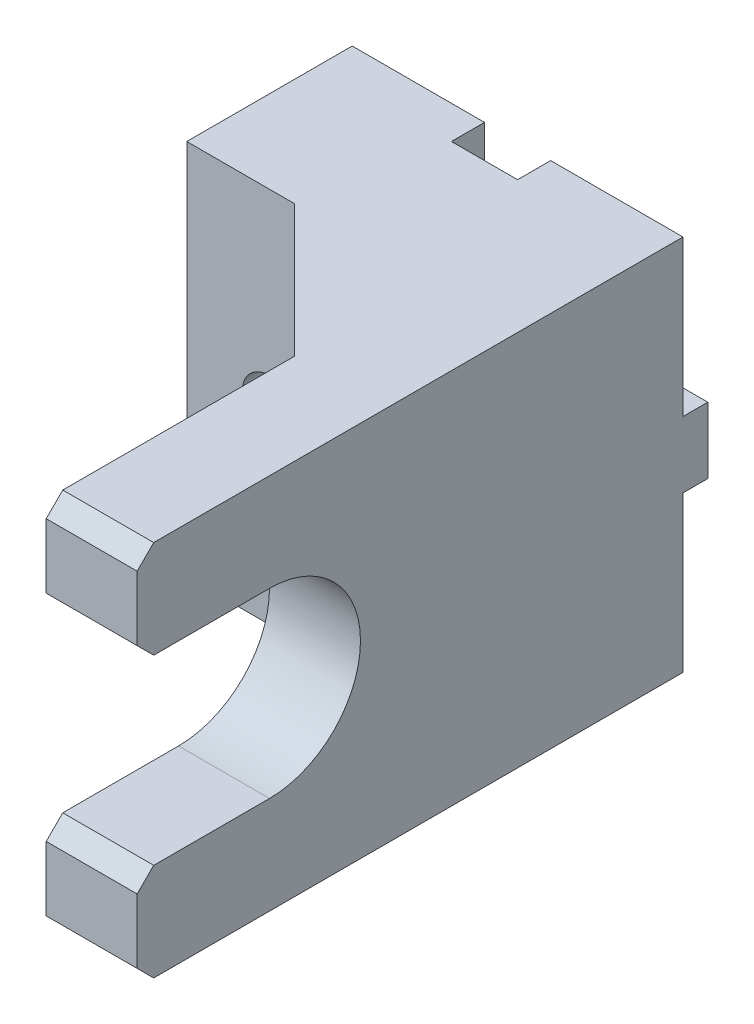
ISO-10303-21;
HEADER;
FILE_DESCRIPTION(('STEP AP214'),'2;1');
FILE_NAME('part.step','',(''),(''),'','','');
FILE_SCHEMA(('AUTOMOTIVE_DESIGN { 1 0 10303 214 1 1 1 1 }'));
ENDSEC;
DATA;
#1=APPLICATION_CONTEXT('core data for automotive mechanical design processes');
#2=APPLICATION_PROTOCOL_DEFINITION('international standard','automotive_design',2000,#1);
#3=PRODUCT_CONTEXT('',#1,'mechanical');
#4=PRODUCT('Part','Part','',(#3));
#5=PRODUCT_RELATED_PRODUCT_CATEGORY('part','',(#4));
#6=PRODUCT_DEFINITION_FORMATION('','',#4);
#7=PRODUCT_DEFINITION_CONTEXT('part definition',#1,'design');
#8=PRODUCT_DEFINITION('design','',#6,#7);
#9=PRODUCT_DEFINITION_SHAPE('','',#8);
#10=(LENGTH_UNIT() NAMED_UNIT(*) SI_UNIT(.MILLI.,.METRE.));
#11=(NAMED_UNIT(*) PLANE_ANGLE_UNIT() SI_UNIT($,.RADIAN.));
#12=(NAMED_UNIT(*) SI_UNIT($,.STERADIAN.) SOLID_ANGLE_UNIT());
#13=UNCERTAINTY_MEASURE_WITH_UNIT(LENGTH_MEASURE(1.E-05),#10,'distance_accuracy_value','');
#14=(GEOMETRIC_REPRESENTATION_CONTEXT(3) GLOBAL_UNCERTAINTY_ASSIGNED_CONTEXT((#13)) GLOBAL_UNIT_ASSIGNED_CONTEXT((#10,
#11,#12)) REPRESENTATION_CONTEXT('',''));
#15=CARTESIAN_POINT('',(0.,0.,0.));
#16=DIRECTION('',(0.,0.,1.));
#17=DIRECTION('',(1.,0.,0.));
#18=AXIS2_PLACEMENT_3D('',#15,#16,#17);
#19=CARTESIAN_POINT('',(324.220096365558,5.46,23.4927569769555));
#20=DIRECTION('',(-0.5,0.,0.866025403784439));
#21=DIRECTION('',(0.866025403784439,0.,0.5));
#22=AXIS2_PLACEMENT_3D('',#19,#20,#21);
#23=PLANE('',#22);
#24=CARTESIAN_POINT('',(322.720096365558,16.86,22.626731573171));
#25=DIRECTION('',(-0.5,0.,0.866025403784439));
#26=DIRECTION('',(-0.866025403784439,0.,-0.5));
#27=AXIS2_PLACEMENT_3D('',#24,#25,#26);
#28=ELLIPSE('',#27,1.90525588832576,1.65);
#29=CARTESIAN_POINT('',(323.354070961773,15.3366562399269,22.9927569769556));
#30=VERTEX_POINT('',#29);
#31=CARTESIAN_POINT('',(324.220096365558,16.1726136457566,23.4927569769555));
#32=VERTEX_POINT('',#31);
#33=EDGE_CURVE('E217',#30,#32,#28,.T.);
#34=ORIENTED_EDGE('',*,*,#33,.T.);
#35=DIRECTION('',(0.,1.,0.));
#36=VECTOR('',#35,1.);
#37=CARTESIAN_POINT('',(324.220096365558,5.46,23.4927569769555));
#38=LINE('',#37,#36);
#39=CARTESIAN_POINT('',(324.220096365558,17.5473863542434,23.4927569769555));
#40=VERTEX_POINT('',#39);
#41=EDGE_CURVE('E223',#32,#40,#38,.T.);
#42=ORIENTED_EDGE('',*,*,#41,.T.);
#43=CARTESIAN_POINT('',(322.720096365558,16.86,22.626731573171));
#44=DIRECTION('',(-0.5,0.,0.866025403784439));
#45=DIRECTION('',(-0.866025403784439,0.,-0.5));
#46=AXIS2_PLACEMENT_3D('',#43,#44,#45);
#47=ELLIPSE('',#46,1.90525588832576,1.65);
#48=CARTESIAN_POINT('',(323.354070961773,18.3833437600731,22.9927569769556));
#49=VERTEX_POINT('',#48);
#50=EDGE_CURVE('E19',#40,#49,#47,.T.);
#51=ORIENTED_EDGE('',*,*,#50,.T.);
#52=DIRECTION('',(0.,1.,0.));
#53=VECTOR('',#52,1.);
#54=CARTESIAN_POINT('',(323.354070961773,5.46,22.9927569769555));
#55=LINE('',#54,#53);
#56=EDGE_CURVE('E236',#30,#49,#55,.T.);
#57=ORIENTED_EDGE('',*,*,#56,.F.);
#58=EDGE_LOOP('',(#34,#42,#51,#57));
#59=FACE_BOUND('',#58,.T.);
#60=ADVANCED_FACE('F16',(#59),#23,.T.);
#61=CARTESIAN_POINT('',(333.720096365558,16.86,26.1927569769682));
#62=DIRECTION('',(0.,0.,-1.));
#63=DIRECTION('',(-1.,0.,0.));
#64=AXIS2_PLACEMENT_3D('',#61,#62,#63);
#65=CONICAL_SURFACE('',#64,1.65000000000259,1.02974425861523);
#66=CARTESIAN_POINT('',(333.720096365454,16.86,27.1841769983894));
#67=VERTEX_POINT('',#66);
#68=VERTEX_LOOP('',#67);
#69=FACE_BOUND('',#68,.T.);
#70=CARTESIAN_POINT('',(333.720096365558,16.86,26.1927569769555));
#71=DIRECTION('',(0.,0.,-1.));
#72=DIRECTION('',(-1.,0.,0.));
#73=AXIS2_PLACEMENT_3D('',#70,#71,#72);
#74=CIRCLE('',#73,1.65);
#75=CARTESIAN_POINT('',(332.070096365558,16.86,26.1927569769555));
#76=VERTEX_POINT('',#75);
#77=EDGE_CURVE('E242',#76,#76,#74,.T.);
#78=ORIENTED_EDGE('',*,*,#77,.T.);
#79=EDGE_LOOP('',(#78));
#80=FACE_BOUND('',#79,.T.);
#81=ADVANCED_FACE('F649',(#69,#80),#65,.F.);
#82=CARTESIAN_POINT('',(323.354070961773,5.46,22.9927569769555));
#83=DIRECTION('',(0.0783008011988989,0.,-0.996929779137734));
#84=DIRECTION('',(-0.996929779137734,0.,-0.0783008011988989));
#85=AXIS2_PLACEMENT_3D('',#82,#83,#84);
#86=PLANE('',#85);
#87=ORIENTED_EDGE('',*,*,#56,.T.);
#88=CARTESIAN_POINT('',(322.720096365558,16.86,22.9429633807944));
#89=DIRECTION('',(0.0783008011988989,0.,-0.996929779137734));
#90=DIRECTION('',(-0.996929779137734,0.,-0.0783008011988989));
#91=AXIS2_PLACEMENT_3D('',#88,#89,#90);
#92=ELLIPSE('',#91,1.65508146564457,1.65);
#93=EDGE_CURVE('E212',#49,#30,#92,.T.);
#94=ORIENTED_EDGE('',*,*,#93,.T.);
#95=EDGE_LOOP('',(#87,#94));
#96=FACE_BOUND('',#95,.T.);
#97=ADVANCED_FACE('F647',(#96),#86,.T.);
#98=CARTESIAN_POINT('',(317.720096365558,14.86,13.4927569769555));
#99=DIRECTION('',(0.,-1.,0.));
#100=DIRECTION('',(0.,0.,-1.));
#101=AXIS2_PLACEMENT_3D('',#98,#99,#100);
#102=PLANE('',#101);
#103=DIRECTION('',(-1.,0.,0.));
#104=VECTOR('',#103,1.);
#105=CARTESIAN_POINT('',(327.720096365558,14.86,11.9927569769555));
#106=LINE('',#105,#104);
#107=CARTESIAN_POINT('',(325.720096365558,14.86,11.9927569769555));
#108=VERTEX_POINT('',#107);
#109=CARTESIAN_POINT('',(317.720096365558,14.86,11.9927569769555));
#110=VERTEX_POINT('',#109);
#111=EDGE_CURVE('E265',#108,#110,#106,.T.);
#112=ORIENTED_EDGE('',*,*,#111,.F.);
#113=DIRECTION('',(0.,0.,-1.));
#114=VECTOR('',#113,1.);
#115=CARTESIAN_POINT('',(325.720096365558,14.86,13.4927569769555));
#116=LINE('',#115,#114);
#117=CARTESIAN_POINT('',(325.720096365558,14.86,13.4927569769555));
#118=VERTEX_POINT('',#117);
#119=EDGE_CURVE('E280',#108,#118,#116,.F.);
#120=ORIENTED_EDGE('',*,*,#119,.T.);
#121=DIRECTION('',(-1.,0.,0.));
#122=VECTOR('',#121,1.);
#123=CARTESIAN_POINT('',(364.220096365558,14.86,13.4927569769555));
#124=LINE('',#123,#122);
#125=CARTESIAN_POINT('',(317.720096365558,14.86,13.4927569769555));
#126=VERTEX_POINT('',#125);
#127=EDGE_CURVE('E258',#126,#118,#124,.F.);
#128=ORIENTED_EDGE('',*,*,#127,.F.);
#129=DIRECTION('',(0.,0.,-1.));
#130=VECTOR('',#129,1.);
#131=CARTESIAN_POINT('',(317.720096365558,14.86,13.4927569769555));
#132=LINE('',#131,#130);
#133=EDGE_CURVE('E238',#126,#110,#132,.T.);
#134=ORIENTED_EDGE('',*,*,#133,.T.);
#135=EDGE_LOOP('',(#112,#120,#128,#134));
#136=FACE_BOUND('',#135,.T.);
#137=ADVANCED_FACE('F285',(#136),#102,.T.);
#138=CARTESIAN_POINT('',(337.720096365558,18.86,13.4927569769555));
#139=DIRECTION('',(0.,1.,0.));
#140=DIRECTION('',(0.,0.,1.));
#141=AXIS2_PLACEMENT_3D('',#138,#139,#140);
#142=PLANE('',#141);
#143=DIRECTION('',(0.,0.,1.));
#144=VECTOR('',#143,1.);
#145=CARTESIAN_POINT('',(317.720096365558,18.86,13.4927569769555));
#146=LINE('',#145,#144);
#147=CARTESIAN_POINT('',(317.720096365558,18.86,11.9927569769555));
#148=VERTEX_POINT('',#147);
#149=CARTESIAN_POINT('',(317.720096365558,18.86,13.4927569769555));
#150=VERTEX_POINT('',#149);
#151=EDGE_CURVE('E273',#148,#150,#146,.T.);
#152=ORIENTED_EDGE('',*,*,#151,.T.);
#153=DIRECTION('',(-1.,0.,0.));
#154=VECTOR('',#153,1.);
#155=CARTESIAN_POINT('',(364.220096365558,18.86,13.4927569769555));
#156=LINE('',#155,#154);
#157=CARTESIAN_POINT('',(325.720096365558,18.86,13.4927569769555));
#158=VERTEX_POINT('',#157);
#159=EDGE_CURVE('E299',#158,#150,#156,.T.);
#160=ORIENTED_EDGE('',*,*,#159,.F.);
#161=DIRECTION('',(0.,0.,1.));
#162=VECTOR('',#161,1.);
#163=CARTESIAN_POINT('',(325.720096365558,18.86,10.9927569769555));
#164=LINE('',#163,#162);
#165=CARTESIAN_POINT('',(325.720096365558,18.86,11.9927569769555));
#166=VERTEX_POINT('',#165);
#167=EDGE_CURVE('E309',#158,#166,#164,.F.);
#168=ORIENTED_EDGE('',*,*,#167,.T.);
#169=DIRECTION('',(-1.,0.,0.));
#170=VECTOR('',#169,1.);
#171=CARTESIAN_POINT('',(327.720096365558,18.86,11.9927569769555));
#172=LINE('',#171,#170);
#173=EDGE_CURVE('E261',#148,#166,#172,.F.);
#174=ORIENTED_EDGE('',*,*,#173,.F.);
#175=EDGE_LOOP('',(#152,#160,#168,#174));
#176=FACE_BOUND('',#175,.T.);
#177=ADVANCED_FACE('F641',(#176),#142,.T.);
#178=CARTESIAN_POINT('',(327.720096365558,16.86,11.9927569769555));
#179=DIRECTION('',(0.,0.,-1.));
#180=DIRECTION('',(-1.,0.,0.));
#181=AXIS2_PLACEMENT_3D('',#178,#179,#180);
#182=PLANE('',#181);
#183=CARTESIAN_POINT('',(322.720096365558,16.86,11.9927569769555));
#184=DIRECTION('',(0.,0.,-1.));
#185=DIRECTION('',(-1.,0.,0.));
#186=AXIS2_PLACEMENT_3D('',#183,#184,#185);
#187=CIRCLE('',#186,1.65);
#188=CARTESIAN_POINT('',(321.070096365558,16.86,11.9927569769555));
#189=VERTEX_POINT('',#188);
#190=EDGE_CURVE('E259',#189,#189,#187,.F.);
#191=ORIENTED_EDGE('',*,*,#190,.T.);
#192=EDGE_LOOP('',(#191));
#193=FACE_BOUND('',#192,.T.);
#194=DIRECTION('',(0.,1.,0.));
#195=VECTOR('',#194,1.);
#196=CARTESIAN_POINT('',(317.720096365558,23.26,11.9927569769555));
#197=LINE('',#196,#195);
#198=EDGE_CURVE('E291',#148,#110,#197,.F.);
#199=ORIENTED_EDGE('',*,*,#198,.F.);
#200=ORIENTED_EDGE('',*,*,#173,.T.);
#201=DIRECTION('',(0.,1.,0.));
#202=VECTOR('',#201,1.);
#203=CARTESIAN_POINT('',(325.720096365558,30.5400024,11.9927569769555));
#204=LINE('',#203,#202);
#205=EDGE_CURVE('E292',#166,#108,#204,.F.);
#206=ORIENTED_EDGE('',*,*,#205,.T.);
#207=ORIENTED_EDGE('',*,*,#111,.T.);
#208=EDGE_LOOP('',(#199,#200,#206,#207));
#209=FACE_BOUND('',#208,.T.);
#210=ADVANCED_FACE('F290',(#193,#209),#182,.T.);
#211=CARTESIAN_POINT('',(322.720096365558,16.86,13.9927569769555));
#212=DIRECTION('',(0.,0.,-1.));
#213=DIRECTION('',(-1.,0.,0.));
#214=AXIS2_PLACEMENT_3D('',#211,#212,#213);
#215=CYLINDRICAL_SURFACE('',#214,1.65);
#216=ORIENTED_EDGE('',*,*,#190,.F.);
#217=EDGE_LOOP('',(#216));
#218=FACE_BOUND('',#217,.T.);
#219=CARTESIAN_POINT('',(322.720096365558,16.86,23.4927569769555));
#220=DIRECTION('',(0.,0.,-1.));
#221=DIRECTION('',(-1.,0.,0.));
#222=AXIS2_PLACEMENT_3D('',#219,#220,#221);
#223=CIRCLE('',#222,1.65);
#224=EDGE_CURVE('E210',#40,#32,#223,.F.);
#225=ORIENTED_EDGE('',*,*,#224,.T.);
#226=ORIENTED_EDGE('',*,*,#33,.F.);
#227=ORIENTED_EDGE('',*,*,#93,.F.);
#228=ORIENTED_EDGE('',*,*,#50,.F.);
#229=EDGE_LOOP('',(#225,#226,#227,#228));
#230=FACE_BOUND('',#229,.T.);
#231=ADVANCED_FACE('F207',(#218,#230),#215,.F.);
#232=CARTESIAN_POINT('',(364.220096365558,16.86,13.4927569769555));
#233=DIRECTION('',(0.,0.,-1.));
#234=DIRECTION('',(-1.,0.,0.));
#235=AXIS2_PLACEMENT_3D('',#232,#233,#234);
#236=PLANE('',#235);
#237=DIRECTION('',(0.,1.,0.));
#238=VECTOR('',#237,1.);
#239=CARTESIAN_POINT('',(317.720096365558,23.26,13.4927569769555));
#240=LINE('',#239,#238);
#241=CARTESIAN_POINT('',(317.720096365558,5.46,13.4927569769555));
#242=VERTEX_POINT('',#241);
#243=EDGE_CURVE('E295',#126,#242,#240,.F.);
#244=ORIENTED_EDGE('',*,*,#243,.F.);
#245=ORIENTED_EDGE('',*,*,#127,.T.);
#246=DIRECTION('',(0.,1.,0.));
#247=VECTOR('',#246,1.);
#248=CARTESIAN_POINT('',(325.720096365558,30.5400024,13.4927569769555));
#249=LINE('',#248,#247);
#250=CARTESIAN_POINT('',(325.720096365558,5.46,13.4927569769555));
#251=VERTEX_POINT('',#250);
#252=EDGE_CURVE('E313',#118,#251,#249,.F.);
#253=ORIENTED_EDGE('',*,*,#252,.T.);
#254=DIRECTION('',(1.,0.,0.));
#255=VECTOR('',#254,1.);
#256=CARTESIAN_POINT('',(334.970096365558,5.46,13.4927569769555));
#257=LINE('',#256,#255);
#258=EDGE_CURVE('E438',#242,#251,#257,.T.);
#259=ORIENTED_EDGE('',*,*,#258,.F.);
#260=EDGE_LOOP('',(#244,#245,#253,#259));
#261=FACE_BOUND('',#260,.T.);
#262=ADVANCED_FACE('F631',(#261),#236,.T.);
#263=CARTESIAN_POINT('',(317.720096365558,14.86,13.4927569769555));
#264=DIRECTION('',(0.,-1.,0.));
#265=DIRECTION('',(0.,0.,-1.));
#266=AXIS2_PLACEMENT_3D('',#263,#264,#265);
#267=PLANE('',#266);
#268=DIRECTION('',(0.,0.,-1.));
#269=VECTOR('',#268,1.);
#270=CARTESIAN_POINT('',(337.720096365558,14.86,13.4927569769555));
#271=LINE('',#270,#269);
#272=CARTESIAN_POINT('',(337.720096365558,14.86,11.9927569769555));
#273=VERTEX_POINT('',#272);
#274=CARTESIAN_POINT('',(337.720096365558,14.86,13.4927569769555));
#275=VERTEX_POINT('',#274);
#276=EDGE_CURVE('E323',#273,#275,#271,.F.);
#277=ORIENTED_EDGE('',*,*,#276,.T.);
#278=DIRECTION('',(-1.,0.,0.));
#279=VECTOR('',#278,1.);
#280=CARTESIAN_POINT('',(364.220096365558,14.86,13.4927569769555));
#281=LINE('',#280,#279);
#282=CARTESIAN_POINT('',(329.720096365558,14.86,13.4927569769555));
#283=VERTEX_POINT('',#282);
#284=EDGE_CURVE('E417',#283,#275,#281,.F.);
#285=ORIENTED_EDGE('',*,*,#284,.F.);
#286=DIRECTION('',(0.,0.,-1.));
#287=VECTOR('',#286,1.);
#288=CARTESIAN_POINT('',(329.720096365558,14.86,15.4927569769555));
#289=LINE('',#288,#287);
#290=CARTESIAN_POINT('',(329.720096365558,14.86,11.9927569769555));
#291=VERTEX_POINT('',#290);
#292=EDGE_CURVE('E319',#283,#291,#289,.T.);
#293=ORIENTED_EDGE('',*,*,#292,.T.);
#294=DIRECTION('',(-1.,0.,0.));
#295=VECTOR('',#294,1.);
#296=CARTESIAN_POINT('',(327.720096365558,14.86,11.9927569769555));
#297=LINE('',#296,#295);
#298=EDGE_CURVE('E414',#273,#291,#297,.T.);
#299=ORIENTED_EDGE('',*,*,#298,.F.);
#300=EDGE_LOOP('',(#277,#285,#293,#299));
#301=FACE_BOUND('',#300,.T.);
#302=ADVANCED_FACE('F627',(#301),#267,.T.);
#303=CARTESIAN_POINT('',(333.720096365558,16.86,11.9927569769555));
#304=DIRECTION('',(0.,0.,-1.));
#305=DIRECTION('',(-1.,0.,0.));
#306=AXIS2_PLACEMENT_3D('',#303,#304,#305);
#307=CYLINDRICAL_SURFACE('',#306,1.65);
#308=ORIENTED_EDGE('',*,*,#77,.F.);
#309=EDGE_LOOP('',(#308));
#310=FACE_BOUND('',#309,.T.);
#311=CARTESIAN_POINT('',(333.720096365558,16.86,11.9927569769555));
#312=DIRECTION('',(0.,0.,-1.));
#313=DIRECTION('',(-1.,0.,0.));
#314=AXIS2_PLACEMENT_3D('',#311,#312,#313);
#315=CIRCLE('',#314,1.65);
#316=CARTESIAN_POINT('',(332.070096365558,16.86,11.9927569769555));
#317=VERTEX_POINT('',#316);
#318=EDGE_CURVE('E252',#317,#317,#315,.F.);
#319=ORIENTED_EDGE('',*,*,#318,.F.);
#320=EDGE_LOOP('',(#319));
#321=FACE_BOUND('',#320,.T.);
#322=ADVANCED_FACE('F623',(#310,#321),#307,.F.);
#323=CARTESIAN_POINT('',(337.720096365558,18.86,13.4927569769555));
#324=DIRECTION('',(0.,1.,0.));
#325=DIRECTION('',(0.,0.,1.));
#326=AXIS2_PLACEMENT_3D('',#323,#324,#325);
#327=PLANE('',#326);
#328=DIRECTION('',(-1.,0.,0.));
#329=VECTOR('',#328,1.);
#330=CARTESIAN_POINT('',(327.720096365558,18.86,11.9927569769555));
#331=LINE('',#330,#329);
#332=CARTESIAN_POINT('',(329.720096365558,18.86,11.9927569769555));
#333=VERTEX_POINT('',#332);
#334=CARTESIAN_POINT('',(337.720096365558,18.86,11.9927569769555));
#335=VERTEX_POINT('',#334);
#336=EDGE_CURVE('E255',#333,#335,#331,.F.);
#337=ORIENTED_EDGE('',*,*,#336,.F.);
#338=DIRECTION('',(0.,0.,-1.));
#339=VECTOR('',#338,1.);
#340=CARTESIAN_POINT('',(329.720096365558,18.86,15.4927569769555));
#341=LINE('',#340,#339);
#342=CARTESIAN_POINT('',(329.720096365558,18.86,13.4927569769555));
#343=VERTEX_POINT('',#342);
#344=EDGE_CURVE('E317',#333,#343,#341,.F.);
#345=ORIENTED_EDGE('',*,*,#344,.T.);
#346=DIRECTION('',(-1.,0.,0.));
#347=VECTOR('',#346,1.);
#348=CARTESIAN_POINT('',(364.220096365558,18.86,13.4927569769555));
#349=LINE('',#348,#347);
#350=CARTESIAN_POINT('',(337.720096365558,18.86,13.4927569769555));
#351=VERTEX_POINT('',#350);
#352=EDGE_CURVE('E254',#351,#343,#349,.T.);
#353=ORIENTED_EDGE('',*,*,#352,.F.);
#354=DIRECTION('',(0.,0.,1.));
#355=VECTOR('',#354,1.);
#356=CARTESIAN_POINT('',(337.720096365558,18.86,13.4927569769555));
#357=LINE('',#356,#355);
#358=EDGE_CURVE('E321',#351,#335,#357,.F.);
#359=ORIENTED_EDGE('',*,*,#358,.T.);
#360=EDGE_LOOP('',(#337,#345,#353,#359));
#361=FACE_BOUND('',#360,.T.);
#362=ADVANCED_FACE('F619',(#361),#327,.T.);
#363=CARTESIAN_POINT('',(329.720096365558,30.5400024,15.4927569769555));
#364=DIRECTION('',(1.,0.,0.));
#365=DIRECTION('',(0.,0.,-1.));
#366=AXIS2_PLACEMENT_3D('',#363,#364,#365);
#367=PLANE('',#366);
#368=DIRECTION('',(0.,1.,0.));
#369=VECTOR('',#368,1.);
#370=CARTESIAN_POINT('',(329.720096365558,16.86,13.4927569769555));
#371=LINE('',#370,#369);
#372=CARTESIAN_POINT('',(329.720096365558,28.26,13.4927569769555));
#373=VERTEX_POINT('',#372);
#374=EDGE_CURVE('E405',#343,#373,#371,.T.);
#375=ORIENTED_EDGE('',*,*,#374,.F.);
#376=ORIENTED_EDGE('',*,*,#344,.F.);
#377=DIRECTION('',(0.,1.,0.));
#378=VECTOR('',#377,1.);
#379=CARTESIAN_POINT('',(329.720096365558,16.86,11.9927569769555));
#380=LINE('',#379,#378);
#381=EDGE_CURVE('E411',#291,#333,#380,.T.);
#382=ORIENTED_EDGE('',*,*,#381,.F.);
#383=ORIENTED_EDGE('',*,*,#292,.F.);
#384=DIRECTION('',(0.,1.,0.));
#385=VECTOR('',#384,1.);
#386=CARTESIAN_POINT('',(329.720096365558,16.86,13.4927569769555));
#387=LINE('',#386,#385);
#388=CARTESIAN_POINT('',(329.720096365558,5.46,13.4927569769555));
#389=VERTEX_POINT('',#388);
#390=EDGE_CURVE('E420',#389,#283,#387,.T.);
#391=ORIENTED_EDGE('',*,*,#390,.F.);
#392=DIRECTION('',(0.,0.,-1.));
#393=VECTOR('',#392,1.);
#394=CARTESIAN_POINT('',(329.720096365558,5.46,29.9927569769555));
#395=LINE('',#394,#393);
#396=CARTESIAN_POINT('',(329.720096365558,5.46,15.4927569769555));
#397=VERTEX_POINT('',#396);
#398=EDGE_CURVE('E430',#397,#389,#395,.T.);
#399=ORIENTED_EDGE('',*,*,#398,.F.);
#400=DIRECTION('',(0.,1.,0.));
#401=VECTOR('',#400,1.);
#402=CARTESIAN_POINT('',(329.720096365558,30.5400024,15.4927569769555));
#403=LINE('',#402,#401);
#404=CARTESIAN_POINT('',(329.720096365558,28.26,15.4927569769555));
#405=VERTEX_POINT('',#404);
#406=EDGE_CURVE('E315',#397,#405,#403,.T.);
#407=ORIENTED_EDGE('',*,*,#406,.T.);
#408=DIRECTION('',(0.,0.,1.));
#409=VECTOR('',#408,1.);
#410=CARTESIAN_POINT('',(329.720096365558,28.26,21.4927569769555));
#411=LINE('',#410,#409);
#412=EDGE_CURVE('E399',#373,#405,#411,.T.);
#413=ORIENTED_EDGE('',*,*,#412,.F.);
#414=EDGE_LOOP('',(#375,#376,#382,#383,#391,#399,#407,#413));
#415=FACE_BOUND('',#414,.T.);
#416=ADVANCED_FACE('F615',(#415),#367,.F.);
#417=CARTESIAN_POINT('',(325.720096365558,30.5400024,15.4927569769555));
#418=DIRECTION('',(0.,0.,1.));
#419=DIRECTION('',(1.,0.,0.));
#420=AXIS2_PLACEMENT_3D('',#417,#418,#419);
#421=PLANE('',#420);
#422=DIRECTION('',(0.,1.,0.));
#423=VECTOR('',#422,1.);
#424=CARTESIAN_POINT('',(325.720096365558,30.5400024,15.4927569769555));
#425=LINE('',#424,#423);
#426=CARTESIAN_POINT('',(325.720096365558,5.46,15.4927569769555));
#427=VERTEX_POINT('',#426);
#428=CARTESIAN_POINT('',(325.720096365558,28.26,15.4927569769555));
#429=VERTEX_POINT('',#428);
#430=EDGE_CURVE('E311',#427,#429,#425,.T.);
#431=ORIENTED_EDGE('',*,*,#430,.T.);
#432=DIRECTION('',(1.,0.,0.));
#433=VECTOR('',#432,1.);
#434=CARTESIAN_POINT('',(337.720096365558,28.26,15.4927569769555));
#435=LINE('',#434,#433);
#436=EDGE_CURVE('E396',#405,#429,#435,.F.);
#437=ORIENTED_EDGE('',*,*,#436,.F.);
#438=ORIENTED_EDGE('',*,*,#406,.F.);
#439=DIRECTION('',(1.,0.,0.));
#440=VECTOR('',#439,1.);
#441=CARTESIAN_POINT('',(334.970096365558,5.46,15.4927569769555));
#442=LINE('',#441,#440);
#443=EDGE_CURVE('E432',#427,#397,#442,.T.);
#444=ORIENTED_EDGE('',*,*,#443,.F.);
#445=EDGE_LOOP('',(#431,#437,#438,#444));
#446=FACE_BOUND('',#445,.T.);
#447=ADVANCED_FACE('F611',(#446),#421,.F.);
#448=CARTESIAN_POINT('',(325.720096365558,30.5400024,10.9927569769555));
#449=DIRECTION('',(-1.,0.,0.));
#450=DIRECTION('',(0.,0.,1.));
#451=AXIS2_PLACEMENT_3D('',#448,#449,#450);
#452=PLANE('',#451);
#453=ORIENTED_EDGE('',*,*,#205,.F.);
#454=ORIENTED_EDGE('',*,*,#167,.F.);
#455=DIRECTION('',(0.,1.,0.));
#456=VECTOR('',#455,1.);
#457=CARTESIAN_POINT('',(325.720096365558,16.86,13.4927569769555));
#458=LINE('',#457,#456);
#459=CARTESIAN_POINT('',(325.720096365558,28.26,13.4927569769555));
#460=VERTEX_POINT('',#459);
#461=EDGE_CURVE('E305',#460,#158,#458,.F.);
#462=ORIENTED_EDGE('',*,*,#461,.F.);
#463=DIRECTION('',(0.,0.,1.));
#464=VECTOR('',#463,1.);
#465=CARTESIAN_POINT('',(325.720096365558,28.26,21.4927569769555));
#466=LINE('',#465,#464);
#467=EDGE_CURVE('E389',#429,#460,#466,.F.);
#468=ORIENTED_EDGE('',*,*,#467,.F.);
#469=ORIENTED_EDGE('',*,*,#430,.F.);
#470=DIRECTION('',(0.,0.,-1.));
#471=VECTOR('',#470,1.);
#472=CARTESIAN_POINT('',(325.720096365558,5.46,29.9927569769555));
#473=LINE('',#472,#471);
#474=EDGE_CURVE('E435',#251,#427,#473,.F.);
#475=ORIENTED_EDGE('',*,*,#474,.F.);
#476=ORIENTED_EDGE('',*,*,#252,.F.);
#477=ORIENTED_EDGE('',*,*,#119,.F.);
#478=EDGE_LOOP('',(#453,#454,#462,#468,#469,#475,#476,#477));
#479=FACE_BOUND('',#478,.T.);
#480=ADVANCED_FACE('F607',(#479),#452,.F.);
#481=CARTESIAN_POINT('',(364.220096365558,16.86,13.4927569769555));
#482=DIRECTION('',(0.,0.,-1.));
#483=DIRECTION('',(-1.,0.,0.));
#484=AXIS2_PLACEMENT_3D('',#481,#482,#483);
#485=PLANE('',#484);
#486=DIRECTION('',(0.,1.,0.));
#487=VECTOR('',#486,1.);
#488=CARTESIAN_POINT('',(317.720096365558,23.26,13.4927569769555));
#489=LINE('',#488,#487);
#490=CARTESIAN_POINT('',(317.720096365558,28.26,13.4927569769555));
#491=VERTEX_POINT('',#490);
#492=EDGE_CURVE('E296',#491,#150,#489,.F.);
#493=ORIENTED_EDGE('',*,*,#492,.F.);
#494=DIRECTION('',(1.,0.,0.));
#495=VECTOR('',#494,1.);
#496=CARTESIAN_POINT('',(337.720096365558,28.26,13.4927569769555));
#497=LINE('',#496,#495);
#498=EDGE_CURVE('E385',#460,#491,#497,.F.);
#499=ORIENTED_EDGE('',*,*,#498,.F.);
#500=ORIENTED_EDGE('',*,*,#461,.T.);
#501=ORIENTED_EDGE('',*,*,#159,.T.);
#502=EDGE_LOOP('',(#493,#499,#500,#501));
#503=FACE_BOUND('',#502,.T.);
#504=ADVANCED_FACE('F604',(#503),#485,.T.);
#505=CARTESIAN_POINT('',(317.720096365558,23.26,21.4927569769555));
#506=DIRECTION('',(-1.,0.,0.));
#507=DIRECTION('',(0.,0.,1.));
#508=AXIS2_PLACEMENT_3D('',#505,#506,#507);
#509=PLANE('',#508);
#510=ORIENTED_EDGE('',*,*,#243,.T.);
#511=DIRECTION('',(0.,0.,-1.));
#512=VECTOR('',#511,1.);
#513=CARTESIAN_POINT('',(317.720096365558,5.46,29.9927569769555));
#514=LINE('',#513,#512);
#515=CARTESIAN_POINT('',(317.720096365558,5.46,23.4927569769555));
#516=VERTEX_POINT('',#515);
#517=EDGE_CURVE('E365',#516,#242,#514,.T.);
#518=ORIENTED_EDGE('',*,*,#517,.F.);
#519=DIRECTION('',(0.,1.,0.));
#520=VECTOR('',#519,1.);
#521=CARTESIAN_POINT('',(317.720096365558,16.86,23.4927569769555));
#522=LINE('',#521,#520);
#523=CARTESIAN_POINT('',(317.720096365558,28.26,23.4927569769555));
#524=VERTEX_POINT('',#523);
#525=EDGE_CURVE('E234',#516,#524,#522,.T.);
#526=ORIENTED_EDGE('',*,*,#525,.T.);
#527=DIRECTION('',(0.,0.,1.));
#528=VECTOR('',#527,1.);
#529=CARTESIAN_POINT('',(317.720096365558,28.26,21.4927569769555));
#530=LINE('',#529,#528);
#531=EDGE_CURVE('E382',#491,#524,#530,.T.);
#532=ORIENTED_EDGE('',*,*,#531,.F.);
#533=ORIENTED_EDGE('',*,*,#492,.T.);
#534=ORIENTED_EDGE('',*,*,#151,.F.);
#535=ORIENTED_EDGE('',*,*,#198,.T.);
#536=ORIENTED_EDGE('',*,*,#133,.F.);
#537=EDGE_LOOP('',(#510,#518,#526,#532,#533,#534,#535,#536));
#538=FACE_BOUND('',#537,.T.);
#539=ADVANCED_FACE('F293',(#538),#509,.T.);
#540=CARTESIAN_POINT('',(364.220096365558,16.86,23.4927569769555));
#541=DIRECTION('',(0.,0.,-1.));
#542=DIRECTION('',(-1.,0.,0.));
#543=AXIS2_PLACEMENT_3D('',#540,#541,#542);
#544=PLANE('',#543);
#545=DIRECTION('',(0.,1.,0.));
#546=VECTOR('',#545,1.);
#547=CARTESIAN_POINT('',(324.220096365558,16.86,23.4927569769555));
#548=LINE('',#547,#546);
#549=CARTESIAN_POINT('',(324.220096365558,28.26,23.4927569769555));
#550=VERTEX_POINT('',#549);
#551=EDGE_CURVE('E220',#550,#40,#548,.F.);
#552=ORIENTED_EDGE('',*,*,#551,.F.);
#553=DIRECTION('',(1.,0.,0.));
#554=VECTOR('',#553,1.);
#555=CARTESIAN_POINT('',(337.720096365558,28.26,23.4927569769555));
#556=LINE('',#555,#554);
#557=EDGE_CURVE('E380',#524,#550,#556,.T.);
#558=ORIENTED_EDGE('',*,*,#557,.F.);
#559=ORIENTED_EDGE('',*,*,#525,.F.);
#560=DIRECTION('',(1.,0.,0.));
#561=VECTOR('',#560,1.);
#562=CARTESIAN_POINT('',(334.970096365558,5.46,23.4927569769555));
#563=LINE('',#562,#561);
#564=CARTESIAN_POINT('',(324.220096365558,5.46,23.4927569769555));
#565=VERTEX_POINT('',#564);
#566=EDGE_CURVE('E362',#565,#516,#563,.F.);
#567=ORIENTED_EDGE('',*,*,#566,.F.);
#568=DIRECTION('',(0.,1.,0.));
#569=VECTOR('',#568,1.);
#570=CARTESIAN_POINT('',(324.220096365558,16.86,23.4927569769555));
#571=LINE('',#570,#569);
#572=EDGE_CURVE('E230',#32,#565,#571,.F.);
#573=ORIENTED_EDGE('',*,*,#572,.F.);
#574=ORIENTED_EDGE('',*,*,#224,.F.);
#575=EDGE_LOOP('',(#552,#558,#559,#567,#573,#574));
#576=FACE_BOUND('',#575,.T.);
#577=ADVANCED_FACE('F232',(#576),#544,.F.);
#578=CARTESIAN_POINT('',(330.970096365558,16.86,30.2427569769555));
#579=DIRECTION('',(-0.707106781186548,0.,0.707106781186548));
#580=DIRECTION('',(0.707106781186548,0.,0.707106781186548));
#581=AXIS2_PLACEMENT_3D('',#578,#579,#580);
#582=PLANE('',#581);
#583=ORIENTED_EDGE('',*,*,#572,.T.);
#584=DIRECTION('',(-0.707106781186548,0.,-0.707106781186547));
#585=VECTOR('',#584,1.);
#586=CARTESIAN_POINT('',(332.220096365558,5.46,31.4927569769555));
#587=LINE('',#586,#585);
#588=CARTESIAN_POINT('',(332.220096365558,5.46,31.4927569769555));
#589=VERTEX_POINT('',#588);
#590=EDGE_CURVE('E369',#589,#565,#587,.T.);
#591=ORIENTED_EDGE('',*,*,#590,.F.);
#592=DIRECTION('',(0.,1.,0.));
#593=VECTOR('',#592,1.);
#594=CARTESIAN_POINT('',(332.220096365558,24.5400024,31.4927569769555));
#595=LINE('',#594,#593);
#596=CARTESIAN_POINT('',(332.220096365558,28.26,31.4927569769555));
#597=VERTEX_POINT('',#596);
#598=EDGE_CURVE('E448',#589,#597,#595,.T.);
#599=ORIENTED_EDGE('',*,*,#598,.T.);
#600=DIRECTION('',(0.707106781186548,0.,0.707106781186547));
#601=VECTOR('',#600,1.);
#602=CARTESIAN_POINT('',(324.220096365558,28.26,23.4927569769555));
#603=LINE('',#602,#601);
#604=EDGE_CURVE('E226',#550,#597,#603,.T.);
#605=ORIENTED_EDGE('',*,*,#604,.F.);
#606=ORIENTED_EDGE('',*,*,#551,.T.);
#607=ORIENTED_EDGE('',*,*,#41,.F.);
#608=EDGE_LOOP('',(#583,#591,#599,#605,#606,#607));
#609=FACE_BOUND('',#608,.T.);
#610=ADVANCED_FACE('F222',(#609),#582,.T.);
#611=CARTESIAN_POINT('',(334.970096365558,27.76,45.9927569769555));
#612=DIRECTION('',(0.,0.707106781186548,0.707106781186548));
#613=DIRECTION('',(0.,-0.707106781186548,0.707106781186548));
#614=AXIS2_PLACEMENT_3D('',#611,#612,#613);
#615=PLANE('',#614);
#616=DIRECTION('',(1.,0.,0.));
#617=VECTOR('',#616,1.);
#618=CARTESIAN_POINT('',(337.720096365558,28.26,45.4927569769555));
#619=LINE('',#618,#617);
#620=CARTESIAN_POINT('',(332.220096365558,28.26,45.4927569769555));
#621=VERTEX_POINT('',#620);
#622=CARTESIAN_POINT('',(337.720096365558,28.26,45.4927569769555));
#623=VERTEX_POINT('',#622);
#624=EDGE_CURVE('E489',#621,#623,#619,.T.);
#625=ORIENTED_EDGE('',*,*,#624,.F.);
#626=DIRECTION('',(0.,-0.707106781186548,0.707106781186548));
#627=VECTOR('',#626,1.);
#628=CARTESIAN_POINT('',(332.220096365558,28.26,45.4927569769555));
#629=LINE('',#628,#627);
#630=CARTESIAN_POINT('',(332.220096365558,27.26,46.4927569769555));
#631=VERTEX_POINT('',#630);
#632=EDGE_CURVE('E445',#621,#631,#629,.T.);
#633=ORIENTED_EDGE('',*,*,#632,.T.);
#634=DIRECTION('',(1.,0.,0.));
#635=VECTOR('',#634,1.);
#636=CARTESIAN_POINT('',(327.720096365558,27.26,46.4927569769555));
#637=LINE('',#636,#635);
#638=CARTESIAN_POINT('',(337.720096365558,27.26,46.4927569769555));
#639=VERTEX_POINT('',#638);
#640=EDGE_CURVE('E347',#639,#631,#637,.F.);
#641=ORIENTED_EDGE('',*,*,#640,.F.);
#642=DIRECTION('',(0.,-0.707106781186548,0.707106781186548));
#643=VECTOR('',#642,1.);
#644=CARTESIAN_POINT('',(337.720096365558,27.76,45.9927569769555));
#645=LINE('',#644,#643);
#646=EDGE_CURVE('E359',#639,#623,#645,.F.);
#647=ORIENTED_EDGE('',*,*,#646,.T.);
#648=EDGE_LOOP('',(#625,#633,#641,#647));
#649=FACE_BOUND('',#648,.T.);
#650=ADVANCED_FACE('F587',(#649),#615,.T.);
#651=CARTESIAN_POINT('',(334.970096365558,22.86,45.9927569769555));
#652=DIRECTION('',(0.,-0.707106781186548,0.707106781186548));
#653=DIRECTION('',(0.,-0.707106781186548,-0.707106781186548));
#654=AXIS2_PLACEMENT_3D('',#651,#652,#653);
#655=PLANE('',#654);
#656=DIRECTION('',(1.,0.,0.));
#657=VECTOR('',#656,1.);
#658=CARTESIAN_POINT('',(327.720096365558,23.36,46.4927569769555));
#659=LINE('',#658,#657);
#660=CARTESIAN_POINT('',(332.220096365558,23.36,46.4927569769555));
#661=VERTEX_POINT('',#660);
#662=CARTESIAN_POINT('',(337.720096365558,23.36,46.4927569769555));
#663=VERTEX_POINT('',#662);
#664=EDGE_CURVE('E338',#661,#663,#659,.T.);
#665=ORIENTED_EDGE('',*,*,#664,.F.);
#666=DIRECTION('',(0.,-0.707106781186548,-0.707106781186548));
#667=VECTOR('',#666,1.);
#668=CARTESIAN_POINT('',(332.220096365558,23.36,46.4927569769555));
#669=LINE('',#668,#667);
#670=CARTESIAN_POINT('',(332.220096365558,22.36,45.4927569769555));
#671=VERTEX_POINT('',#670);
#672=EDGE_CURVE('E447',#661,#671,#669,.T.);
#673=ORIENTED_EDGE('',*,*,#672,.T.);
#674=DIRECTION('',(1.,0.,0.));
#675=VECTOR('',#674,1.);
#676=CARTESIAN_POINT('',(339.720098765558,22.36,45.4927569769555));
#677=LINE('',#676,#675);
#678=CARTESIAN_POINT('',(337.720096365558,22.36,45.4927569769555));
#679=VERTEX_POINT('',#678);
#680=EDGE_CURVE('E465',#671,#679,#677,.T.);
#681=ORIENTED_EDGE('',*,*,#680,.T.);
#682=DIRECTION('',(0.,-0.707106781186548,-0.707106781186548));
#683=VECTOR('',#682,1.);
#684=CARTESIAN_POINT('',(337.720096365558,22.86,45.9927569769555));
#685=LINE('',#684,#683);
#686=EDGE_CURVE('E452',#679,#663,#685,.F.);
#687=ORIENTED_EDGE('',*,*,#686,.T.);
#688=EDGE_LOOP('',(#665,#673,#681,#687));
#689=FACE_BOUND('',#688,.T.);
#690=ADVANCED_FACE('F586',(#689),#655,.T.);
#691=CARTESIAN_POINT('',(334.970096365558,5.96,45.9927569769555));
#692=DIRECTION('',(0.,-0.707106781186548,0.707106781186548));
#693=DIRECTION('',(0.,-0.707106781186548,-0.707106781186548));
#694=AXIS2_PLACEMENT_3D('',#691,#692,#693);
#695=PLANE('',#694);
#696=DIRECTION('',(1.,0.,0.));
#697=VECTOR('',#696,1.);
#698=CARTESIAN_POINT('',(334.970096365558,5.46,45.4927569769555));
#699=LINE('',#698,#697);
#700=CARTESIAN_POINT('',(337.720096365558,5.46,45.4927569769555));
#701=VERTEX_POINT('',#700);
#702=CARTESIAN_POINT('',(332.220096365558,5.46,45.4927569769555));
#703=VERTEX_POINT('',#702);
#704=EDGE_CURVE('E427',#701,#703,#699,.F.);
#705=ORIENTED_EDGE('',*,*,#704,.F.);
#706=DIRECTION('',(0.,-0.707106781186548,-0.707106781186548));
#707=VECTOR('',#706,1.);
#708=CARTESIAN_POINT('',(337.720096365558,5.96,45.9927569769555));
#709=LINE('',#708,#707);
#710=CARTESIAN_POINT('',(337.720096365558,6.46,46.4927569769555));
#711=VERTEX_POINT('',#710);
#712=EDGE_CURVE('E34',#701,#711,#709,.F.);
#713=ORIENTED_EDGE('',*,*,#712,.T.);
#714=DIRECTION('',(1.,0.,0.));
#715=VECTOR('',#714,1.);
#716=CARTESIAN_POINT('',(327.720096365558,6.46,46.4927569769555));
#717=LINE('',#716,#715);
#718=CARTESIAN_POINT('',(332.220096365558,6.46,46.4927569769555));
#719=VERTEX_POINT('',#718);
#720=EDGE_CURVE('E335',#719,#711,#717,.T.);
#721=ORIENTED_EDGE('',*,*,#720,.F.);
#722=DIRECTION('',(0.,-0.707106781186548,-0.707106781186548));
#723=VECTOR('',#722,1.);
#724=CARTESIAN_POINT('',(332.220096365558,6.46,46.4927569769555));
#725=LINE('',#724,#723);
#726=EDGE_CURVE('E366',#719,#703,#725,.T.);
#727=ORIENTED_EDGE('',*,*,#726,.T.);
#728=EDGE_LOOP('',(#705,#713,#721,#727));
#729=FACE_BOUND('',#728,.T.);
#730=ADVANCED_FACE('F595',(#729),#695,.T.);
#731=CARTESIAN_POINT('',(334.970096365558,10.86,45.9927569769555));
#732=DIRECTION('',(0.,0.707106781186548,0.707106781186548));
#733=DIRECTION('',(0.,-0.707106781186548,0.707106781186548));
#734=AXIS2_PLACEMENT_3D('',#731,#732,#733);
#735=PLANE('',#734);
#736=DIRECTION('',(1.,0.,0.));
#737=VECTOR('',#736,1.);
#738=CARTESIAN_POINT('',(327.720096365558,10.36,46.4927569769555));
#739=LINE('',#738,#737);
#740=CARTESIAN_POINT('',(337.720096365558,10.36,46.4927569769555));
#741=VERTEX_POINT('',#740);
#742=CARTESIAN_POINT('',(332.220096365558,10.36,46.4927569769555));
#743=VERTEX_POINT('',#742);
#744=EDGE_CURVE('E330',#741,#743,#739,.F.);
#745=ORIENTED_EDGE('',*,*,#744,.F.);
#746=DIRECTION('',(0.,-0.707106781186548,0.707106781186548));
#747=VECTOR('',#746,1.);
#748=CARTESIAN_POINT('',(337.720096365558,10.86,45.9927569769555));
#749=LINE('',#748,#747);
#750=CARTESIAN_POINT('',(337.720096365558,11.36,45.4927569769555));
#751=VERTEX_POINT('',#750);
#752=EDGE_CURVE('E450',#741,#751,#749,.F.);
#753=ORIENTED_EDGE('',*,*,#752,.T.);
#754=DIRECTION('',(1.,0.,0.));
#755=VECTOR('',#754,1.);
#756=CARTESIAN_POINT('',(339.720098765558,11.36,45.4927569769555));
#757=LINE('',#756,#755);
#758=CARTESIAN_POINT('',(332.220096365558,11.36,45.4927569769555));
#759=VERTEX_POINT('',#758);
#760=EDGE_CURVE('E572',#751,#759,#757,.F.);
#761=ORIENTED_EDGE('',*,*,#760,.T.);
#762=DIRECTION('',(0.,-0.707106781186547,0.707106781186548));
#763=VECTOR('',#762,1.);
#764=CARTESIAN_POINT('',(332.220096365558,11.36,45.4927569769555));
#765=LINE('',#764,#763);
#766=EDGE_CURVE('E444',#759,#743,#765,.T.);
#767=ORIENTED_EDGE('',*,*,#766,.T.);
#768=EDGE_LOOP('',(#745,#753,#761,#767));
#769=FACE_BOUND('',#768,.T.);
#770=ADVANCED_FACE('F577',(#769),#735,.T.);
#771=CARTESIAN_POINT('',(332.220096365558,24.5400024,50.6927569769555));
#772=DIRECTION('',(1.,0.,0.));
#773=DIRECTION('',(0.,0.,-1.));
#774=AXIS2_PLACEMENT_3D('',#771,#772,#773);
#775=PLANE('',#774);
#776=ORIENTED_EDGE('',*,*,#726,.F.);
#777=DIRECTION('',(0.,1.,0.));
#778=VECTOR('',#777,1.);
#779=CARTESIAN_POINT('',(332.220096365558,16.86,46.4927569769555));
#780=LINE('',#779,#778);
#781=EDGE_CURVE('E326',#743,#719,#780,.F.);
#782=ORIENTED_EDGE('',*,*,#781,.F.);
#783=ORIENTED_EDGE('',*,*,#766,.F.);
#784=DIRECTION('',(0.,0.,-1.));
#785=VECTOR('',#784,1.);
#786=CARTESIAN_POINT('',(332.220096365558,11.36,47.4913340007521));
#787=LINE('',#786,#785);
#788=CARTESIAN_POINT('',(332.220096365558,11.36,38.4927569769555));
#789=VERTEX_POINT('',#788);
#790=EDGE_CURVE('E250',#759,#789,#787,.T.);
#791=ORIENTED_EDGE('',*,*,#790,.T.);
#792=CARTESIAN_POINT('',(332.220096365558,16.86,38.4927569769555));
#793=DIRECTION('',(-1.,0.,0.));
#794=DIRECTION('',(0.,0.,1.));
#795=AXIS2_PLACEMENT_3D('',#792,#793,#794);
#796=CIRCLE('',#795,5.5);
#797=CARTESIAN_POINT('',(332.220096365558,22.36,38.4927569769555));
#798=VERTEX_POINT('',#797);
#799=EDGE_CURVE('E247',#789,#798,#796,.F.);
#800=ORIENTED_EDGE('',*,*,#799,.T.);
#801=DIRECTION('',(0.,0.,1.));
#802=VECTOR('',#801,1.);
#803=CARTESIAN_POINT('',(332.220096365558,22.36,38.4927569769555));
#804=LINE('',#803,#802);
#805=EDGE_CURVE('E341',#798,#671,#804,.T.);
#806=ORIENTED_EDGE('',*,*,#805,.T.);
#807=ORIENTED_EDGE('',*,*,#672,.F.);
#808=DIRECTION('',(0.,1.,0.));
#809=VECTOR('',#808,1.);
#810=CARTESIAN_POINT('',(332.220096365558,16.86,46.4927569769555));
#811=LINE('',#810,#809);
#812=EDGE_CURVE('E342',#631,#661,#811,.F.);
#813=ORIENTED_EDGE('',*,*,#812,.F.);
#814=ORIENTED_EDGE('',*,*,#632,.F.);
#815=DIRECTION('',(0.,0.,1.));
#816=VECTOR('',#815,1.);
#817=CARTESIAN_POINT('',(332.220096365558,28.26,21.4927569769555));
#818=LINE('',#817,#816);
#819=EDGE_CURVE('E379',#597,#621,#818,.T.);
#820=ORIENTED_EDGE('',*,*,#819,.F.);
#821=ORIENTED_EDGE('',*,*,#598,.F.);
#822=DIRECTION('',(0.,0.,-1.));
#823=VECTOR('',#822,1.);
#824=CARTESIAN_POINT('',(332.220096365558,5.46,29.9927569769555));
#825=LINE('',#824,#823);
#826=EDGE_CURVE('E373',#703,#589,#825,.T.);
#827=ORIENTED_EDGE('',*,*,#826,.F.);
#828=EDGE_LOOP('',(#776,#782,#783,#791,#800,#806,#807,#813,#814,#820,#821,#827));
#829=FACE_BOUND('',#828,.T.);
#830=ADVANCED_FACE('F482',(#829),#775,.F.);
#831=CARTESIAN_POINT('',(334.970096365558,5.46,29.9927569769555));
#832=DIRECTION('',(0.,-1.,0.));
#833=DIRECTION('',(0.,0.,-1.));
#834=AXIS2_PLACEMENT_3D('',#831,#832,#833);
#835=PLANE('',#834);
#836=ORIENTED_EDGE('',*,*,#826,.T.);
#837=ORIENTED_EDGE('',*,*,#590,.T.);
#838=ORIENTED_EDGE('',*,*,#566,.T.);
#839=ORIENTED_EDGE('',*,*,#517,.T.);
#840=ORIENTED_EDGE('',*,*,#258,.T.);
#841=ORIENTED_EDGE('',*,*,#474,.T.);
#842=ORIENTED_EDGE('',*,*,#443,.T.);
#843=ORIENTED_EDGE('',*,*,#398,.T.);
#844=DIRECTION('',(-1.,0.,0.));
#845=VECTOR('',#844,1.);
#846=CARTESIAN_POINT('',(364.220096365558,5.46,13.4927569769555));
#847=LINE('',#846,#845);
#848=CARTESIAN_POINT('',(337.720096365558,5.46,13.4927569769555));
#849=VERTEX_POINT('',#848);
#850=EDGE_CURVE('E372',#849,#389,#847,.T.);
#851=ORIENTED_EDGE('',*,*,#850,.F.);
#852=DIRECTION('',(0.,0.,-1.));
#853=VECTOR('',#852,1.);
#854=CARTESIAN_POINT('',(337.720096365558,5.46,21.4927569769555));
#855=LINE('',#854,#853);
#856=EDGE_CURVE('E329',#701,#849,#855,.T.);
#857=ORIENTED_EDGE('',*,*,#856,.F.);
#858=ORIENTED_EDGE('',*,*,#704,.T.);
#859=EDGE_LOOP('',(#836,#837,#838,#839,#840,#841,#842,#843,#851,#857,#858));
#860=FACE_BOUND('',#859,.T.);
#861=ADVANCED_FACE('F477',(#860),#835,.T.);
#862=CARTESIAN_POINT('',(364.220096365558,16.86,13.4927569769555));
#863=DIRECTION('',(0.,0.,-1.));
#864=DIRECTION('',(-1.,0.,0.));
#865=AXIS2_PLACEMENT_3D('',#862,#863,#864);
#866=PLANE('',#865);
#867=ORIENTED_EDGE('',*,*,#390,.T.);
#868=ORIENTED_EDGE('',*,*,#284,.T.);
#869=DIRECTION('',(0.,1.,0.));
#870=VECTOR('',#869,1.);
#871=CARTESIAN_POINT('',(337.720096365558,10.46,13.4927569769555));
#872=LINE('',#871,#870);
#873=EDGE_CURVE('E566',#849,#275,#872,.T.);
#874=ORIENTED_EDGE('',*,*,#873,.F.);
#875=ORIENTED_EDGE('',*,*,#850,.T.);
#876=EDGE_LOOP('',(#867,#868,#874,#875));
#877=FACE_BOUND('',#876,.T.);
#878=ADVANCED_FACE('F665',(#877),#866,.T.);
#879=CARTESIAN_POINT('',(327.720096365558,16.86,11.9927569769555));
#880=DIRECTION('',(0.,0.,-1.));
#881=DIRECTION('',(-1.,0.,0.));
#882=AXIS2_PLACEMENT_3D('',#879,#880,#881);
#883=PLANE('',#882);
#884=ORIENTED_EDGE('',*,*,#318,.T.);
#885=EDGE_LOOP('',(#884));
#886=FACE_BOUND('',#885,.T.);
#887=ORIENTED_EDGE('',*,*,#336,.T.);
#888=DIRECTION('',(0.,1.,0.));
#889=VECTOR('',#888,1.);
#890=CARTESIAN_POINT('',(337.720096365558,10.46,11.9927569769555));
#891=LINE('',#890,#889);
#892=EDGE_CURVE('E558',#273,#335,#891,.T.);
#893=ORIENTED_EDGE('',*,*,#892,.F.);
#894=ORIENTED_EDGE('',*,*,#298,.T.);
#895=ORIENTED_EDGE('',*,*,#381,.T.);
#896=EDGE_LOOP('',(#887,#893,#894,#895));
#897=FACE_BOUND('',#896,.T.);
#898=ADVANCED_FACE('F504',(#886,#897),#883,.T.);
#899=CARTESIAN_POINT('',(364.220096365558,16.86,13.4927569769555));
#900=DIRECTION('',(0.,0.,-1.));
#901=DIRECTION('',(-1.,0.,0.));
#902=AXIS2_PLACEMENT_3D('',#899,#900,#901);
#903=PLANE('',#902);
#904=DIRECTION('',(1.,0.,0.));
#905=VECTOR('',#904,1.);
#906=CARTESIAN_POINT('',(337.720096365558,28.26,13.4927569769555));
#907=LINE('',#906,#905);
#908=CARTESIAN_POINT('',(337.720096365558,28.26,13.4927569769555));
#909=VERTEX_POINT('',#908);
#910=EDGE_CURVE('E402',#909,#373,#907,.F.);
#911=ORIENTED_EDGE('',*,*,#910,.F.);
#912=DIRECTION('',(0.,1.,0.));
#913=VECTOR('',#912,1.);
#914=CARTESIAN_POINT('',(337.720096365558,10.46,13.4927569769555));
#915=LINE('',#914,#913);
#916=EDGE_CURVE('E556',#351,#909,#915,.T.);
#917=ORIENTED_EDGE('',*,*,#916,.F.);
#918=ORIENTED_EDGE('',*,*,#352,.T.);
#919=ORIENTED_EDGE('',*,*,#374,.T.);
#920=EDGE_LOOP('',(#911,#917,#918,#919));
#921=FACE_BOUND('',#920,.T.);
#922=ADVANCED_FACE('F493',(#921),#903,.T.);
#923=CARTESIAN_POINT('',(337.720096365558,28.26,21.4927569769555));
#924=DIRECTION('',(0.,1.,0.));
#925=DIRECTION('',(0.,0.,1.));
#926=AXIS2_PLACEMENT_3D('',#923,#924,#925);
#927=PLANE('',#926);
#928=ORIENTED_EDGE('',*,*,#819,.T.);
#929=ORIENTED_EDGE('',*,*,#624,.T.);
#930=DIRECTION('',(0.,0.,-1.));
#931=VECTOR('',#930,1.);
#932=CARTESIAN_POINT('',(337.720096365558,28.26,21.4927569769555));
#933=LINE('',#932,#931);
#934=EDGE_CURVE('E355',#909,#623,#933,.F.);
#935=ORIENTED_EDGE('',*,*,#934,.F.);
#936=ORIENTED_EDGE('',*,*,#910,.T.);
#937=ORIENTED_EDGE('',*,*,#412,.T.);
#938=ORIENTED_EDGE('',*,*,#436,.T.);
#939=ORIENTED_EDGE('',*,*,#467,.T.);
#940=ORIENTED_EDGE('',*,*,#498,.T.);
#941=ORIENTED_EDGE('',*,*,#531,.T.);
#942=ORIENTED_EDGE('',*,*,#557,.T.);
#943=ORIENTED_EDGE('',*,*,#604,.T.);
#944=EDGE_LOOP('',(#928,#929,#935,#936,#937,#938,#939,#940,#941,#942,#943));
#945=FACE_BOUND('',#944,.T.);
#946=ADVANCED_FACE('F490',(#945),#927,.T.);
#947=CARTESIAN_POINT('',(327.720096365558,16.86,46.4927569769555));
#948=DIRECTION('',(0.,0.,1.));
#949=DIRECTION('',(1.,0.,0.));
#950=AXIS2_PLACEMENT_3D('',#947,#948,#949);
#951=PLANE('',#950);
#952=ORIENTED_EDGE('',*,*,#664,.T.);
#953=DIRECTION('',(0.,1.,0.));
#954=VECTOR('',#953,1.);
#955=CARTESIAN_POINT('',(337.720096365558,10.46,46.4927569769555));
#956=LINE('',#955,#954);
#957=EDGE_CURVE('E352',#639,#663,#956,.F.);
#958=ORIENTED_EDGE('',*,*,#957,.F.);
#959=ORIENTED_EDGE('',*,*,#640,.T.);
#960=ORIENTED_EDGE('',*,*,#812,.T.);
#961=EDGE_LOOP('',(#952,#958,#959,#960));
#962=FACE_BOUND('',#961,.T.);
#963=ADVANCED_FACE('F492',(#962),#951,.T.);
#964=CARTESIAN_POINT('',(339.720098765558,22.36,38.4927569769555));
#965=DIRECTION('',(0.,1.,0.));
#966=DIRECTION('',(0.,0.,1.));
#967=AXIS2_PLACEMENT_3D('',#964,#965,#966);
#968=PLANE('',#967);
#969=ORIENTED_EDGE('',*,*,#805,.F.);
#970=DIRECTION('',(-1.,0.,0.));
#971=VECTOR('',#970,1.);
#972=CARTESIAN_POINT('',(339.720098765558,22.36,38.4927569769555));
#973=LINE('',#972,#971);
#974=CARTESIAN_POINT('',(337.720096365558,22.36,38.4927569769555));
#975=VERTEX_POINT('',#974);
#976=EDGE_CURVE('E251',#798,#975,#973,.F.);
#977=ORIENTED_EDGE('',*,*,#976,.T.);
#978=DIRECTION('',(0.,0.,-1.));
#979=VECTOR('',#978,1.);
#980=CARTESIAN_POINT('',(337.720096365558,22.36,21.4927569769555));
#981=LINE('',#980,#979);
#982=EDGE_CURVE('E246',#679,#975,#981,.T.);
#983=ORIENTED_EDGE('',*,*,#982,.F.);
#984=ORIENTED_EDGE('',*,*,#680,.F.);
#985=EDGE_LOOP('',(#969,#977,#983,#984));
#986=FACE_BOUND('',#985,.T.);
#987=ADVANCED_FACE('F501',(#986),#968,.F.);
#988=CARTESIAN_POINT('',(339.720098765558,16.86,38.4927569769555));
#989=DIRECTION('',(-1.,0.,0.));
#990=DIRECTION('',(0.,0.,1.));
#991=AXIS2_PLACEMENT_3D('',#988,#989,#990);
#992=CYLINDRICAL_SURFACE('',#991,5.5);
#993=DIRECTION('',(1.,0.,0.));
#994=VECTOR('',#993,1.);
#995=CARTESIAN_POINT('',(339.720098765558,11.36,38.4927569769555));
#996=LINE('',#995,#994);
#997=CARTESIAN_POINT('',(337.720096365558,11.36,38.4927569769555));
#998=VERTEX_POINT('',#997);
#999=EDGE_CURVE('E457',#789,#998,#996,.T.);
#1000=ORIENTED_EDGE('',*,*,#999,.T.);
#1001=CARTESIAN_POINT('',(337.720096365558,16.86,38.4927569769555));
#1002=DIRECTION('',(-1.,0.,0.));
#1003=DIRECTION('',(0.,0.,1.));
#1004=AXIS2_PLACEMENT_3D('',#1001,#1002,#1003);
#1005=CIRCLE('',#1004,5.5);
#1006=EDGE_CURVE('E243',#975,#998,#1005,.T.);
#1007=ORIENTED_EDGE('',*,*,#1006,.F.);
#1008=ORIENTED_EDGE('',*,*,#976,.F.);
#1009=ORIENTED_EDGE('',*,*,#799,.F.);
#1010=EDGE_LOOP('',(#1000,#1007,#1008,#1009));
#1011=FACE_BOUND('',#1010,.T.);
#1012=ADVANCED_FACE('F522',(#1011),#992,.F.);
#1013=CARTESIAN_POINT('',(339.720098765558,11.36,47.4913340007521));
#1014=DIRECTION('',(0.,-1.,0.));
#1015=DIRECTION('',(0.,0.,-1.));
#1016=AXIS2_PLACEMENT_3D('',#1013,#1014,#1015);
#1017=PLANE('',#1016);
#1018=DIRECTION('',(0.,0.,-1.));
#1019=VECTOR('',#1018,1.);
#1020=CARTESIAN_POINT('',(337.720096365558,11.36,21.4927569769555));
#1021=LINE('',#1020,#1019);
#1022=EDGE_CURVE('E25',#998,#751,#1021,.F.);
#1023=ORIENTED_EDGE('',*,*,#1022,.F.);
#1024=ORIENTED_EDGE('',*,*,#999,.F.);
#1025=ORIENTED_EDGE('',*,*,#790,.F.);
#1026=ORIENTED_EDGE('',*,*,#760,.F.);
#1027=EDGE_LOOP('',(#1023,#1024,#1025,#1026));
#1028=FACE_BOUND('',#1027,.T.);
#1029=ADVANCED_FACE('F516',(#1028),#1017,.F.);
#1030=CARTESIAN_POINT('',(327.720096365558,16.86,46.4927569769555));
#1031=DIRECTION('',(0.,0.,1.));
#1032=DIRECTION('',(1.,0.,0.));
#1033=AXIS2_PLACEMENT_3D('',#1030,#1031,#1032);
#1034=PLANE('',#1033);
#1035=ORIENTED_EDGE('',*,*,#744,.T.);
#1036=ORIENTED_EDGE('',*,*,#781,.T.);
#1037=ORIENTED_EDGE('',*,*,#720,.T.);
#1038=DIRECTION('',(0.,1.,0.));
#1039=VECTOR('',#1038,1.);
#1040=CARTESIAN_POINT('',(337.720096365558,10.46,46.4927569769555));
#1041=LINE('',#1040,#1039);
#1042=EDGE_CURVE('E11',#741,#711,#1041,.F.);
#1043=ORIENTED_EDGE('',*,*,#1042,.F.);
#1044=EDGE_LOOP('',(#1035,#1036,#1037,#1043));
#1045=FACE_BOUND('',#1044,.T.);
#1046=ADVANCED_FACE('F509',(#1045),#1034,.T.);
#1047=CARTESIAN_POINT('',(337.720096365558,10.46,21.4927569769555));
#1048=DIRECTION('',(1.,0.,0.));
#1049=DIRECTION('',(0.,0.,-1.));
#1050=AXIS2_PLACEMENT_3D('',#1047,#1048,#1049);
#1051=PLANE('',#1050);
#1052=ORIENTED_EDGE('',*,*,#1042,.T.);
#1053=ORIENTED_EDGE('',*,*,#712,.F.);
#1054=ORIENTED_EDGE('',*,*,#856,.T.);
#1055=ORIENTED_EDGE('',*,*,#873,.T.);
#1056=ORIENTED_EDGE('',*,*,#276,.F.);
#1057=ORIENTED_EDGE('',*,*,#892,.T.);
#1058=ORIENTED_EDGE('',*,*,#358,.F.);
#1059=ORIENTED_EDGE('',*,*,#916,.T.);
#1060=ORIENTED_EDGE('',*,*,#934,.T.);
#1061=ORIENTED_EDGE('',*,*,#646,.F.);
#1062=ORIENTED_EDGE('',*,*,#957,.T.);
#1063=ORIENTED_EDGE('',*,*,#686,.F.);
#1064=ORIENTED_EDGE('',*,*,#982,.T.);
#1065=ORIENTED_EDGE('',*,*,#1006,.T.);
#1066=ORIENTED_EDGE('',*,*,#1022,.T.);
#1067=ORIENTED_EDGE('',*,*,#752,.F.);
#1068=EDGE_LOOP('',(#1052,#1053,#1054,#1055,#1056,#1057,#1058,#1059,#1060,#1061,#1062,#1063,
#1064,#1065,#1066,#1067));
#1069=FACE_BOUND('',#1068,.T.);
#1070=ADVANCED_FACE('F507',(#1069),#1051,.T.);
#1071=CLOSED_SHELL('',(#60,#81,#97,#137,#177,#210,#231,#262,#302,#322,#362,#416,#447,#480,#504,
#539,#577,#610,#650,#690,#730,#770,#830,#861,#878,#898,#922,#946,#963,#987,#1012,#1029,#1046,#1070));
#1072=MANIFOLD_SOLID_BREP('B1',#1071);
#1073=ADVANCED_BREP_SHAPE_REPRESENTATION('',(#18,#1072),#14);
#1074=SHAPE_DEFINITION_REPRESENTATION(#9,#1073);
ENDSEC;
END-ISO-10303-21;
